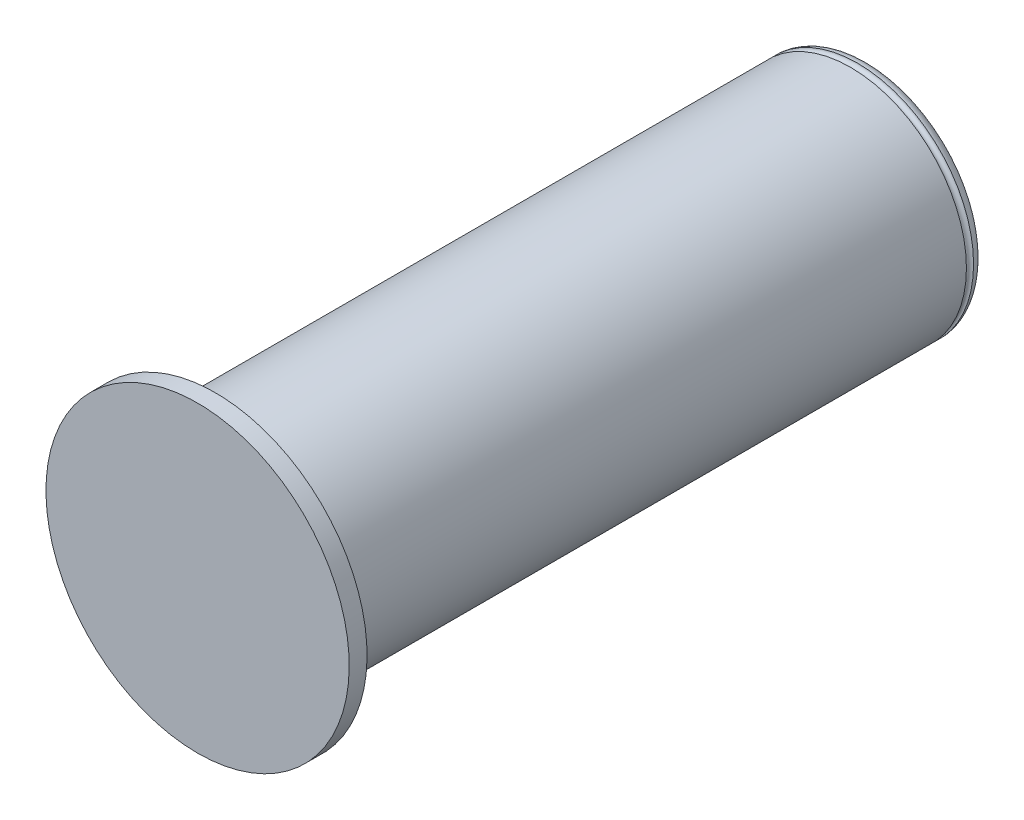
ISO-10303-21;
HEADER;
FILE_DESCRIPTION(('STEP AP214'),'2;1');
FILE_NAME('part.step','',(''),(''),'','','');
FILE_SCHEMA(('AUTOMOTIVE_DESIGN { 1 0 10303 214 1 1 1 1 }'));
ENDSEC;
DATA;
#1=APPLICATION_CONTEXT('core data for automotive mechanical design processes');
#2=APPLICATION_PROTOCOL_DEFINITION('international standard','automotive_design',2000,#1);
#3=PRODUCT_CONTEXT('',#1,'mechanical');
#4=PRODUCT('Part','Part','',(#3));
#5=PRODUCT_RELATED_PRODUCT_CATEGORY('part','',(#4));
#6=PRODUCT_DEFINITION_FORMATION('','',#4);
#7=PRODUCT_DEFINITION_CONTEXT('part definition',#1,'design');
#8=PRODUCT_DEFINITION('design','',#6,#7);
#9=PRODUCT_DEFINITION_SHAPE('','',#8);
#10=(LENGTH_UNIT() NAMED_UNIT(*) SI_UNIT(.MILLI.,.METRE.));
#11=(NAMED_UNIT(*) PLANE_ANGLE_UNIT() SI_UNIT($,.RADIAN.));
#12=(NAMED_UNIT(*) SI_UNIT($,.STERADIAN.) SOLID_ANGLE_UNIT());
#13=UNCERTAINTY_MEASURE_WITH_UNIT(LENGTH_MEASURE(1.E-05),#10,'distance_accuracy_value','');
#14=(GEOMETRIC_REPRESENTATION_CONTEXT(3) GLOBAL_UNCERTAINTY_ASSIGNED_CONTEXT((#13)) GLOBAL_UNIT_ASSIGNED_CONTEXT((#10,
#11,#12)) REPRESENTATION_CONTEXT('',''));
#15=CARTESIAN_POINT('',(0.,0.,0.));
#16=DIRECTION('',(0.,0.,1.));
#17=DIRECTION('',(1.,0.,0.));
#18=AXIS2_PLACEMENT_3D('',#15,#16,#17);
#19=CARTESIAN_POINT('',(0.,0.,-185.));
#20=DIRECTION('',(0.,0.,1.));
#21=DIRECTION('',(0.,-1.,0.));
#22=AXIS2_PLACEMENT_3D('',#19,#20,#21);
#23=TOROIDAL_SURFACE('',#22,29.5,3.);
#24=CARTESIAN_POINT('',(0.,0.,-184.999999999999));
#25=DIRECTION('',(0.,0.,1.));
#26=DIRECTION('',(1.,0.,0.));
#27=AXIS2_PLACEMENT_3D('',#24,#25,#26);
#28=CIRCLE('',#27,32.4999999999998);
#29=CARTESIAN_POINT('',(32.4999999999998,0.,-184.999999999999));
#30=VERTEX_POINT('',#29);
#31=EDGE_CURVE('E109',#30,#30,#28,.T.);
#32=ORIENTED_EDGE('',*,*,#31,.F.);
#33=EDGE_LOOP('',(#32));
#34=FACE_BOUND('',#33,.T.);
#35=CARTESIAN_POINT('',(0.,0.,-188.));
#36=DIRECTION('',(0.,0.,1.));
#37=DIRECTION('',(0.,-1.,0.));
#38=AXIS2_PLACEMENT_3D('',#35,#36,#37);
#39=CIRCLE('',#38,29.5);
#40=CARTESIAN_POINT('',(0.,-29.5,-188.));
#41=VERTEX_POINT('',#40);
#42=EDGE_CURVE('E92',#41,#41,#39,.T.);
#43=ORIENTED_EDGE('',*,*,#42,.T.);
#44=EDGE_LOOP('',(#43));
#45=FACE_BOUND('',#44,.T.);
#46=ADVANCED_FACE('F32',(#34,#45),#23,.T.);
#47=CARTESIAN_POINT('',(0.,29.5,-188.));
#48=DIRECTION('',(0.,0.,1.));
#49=DIRECTION('',(0.,-1.,0.));
#50=AXIS2_PLACEMENT_3D('',#47,#48,#49);
#51=PLANE('',#50);
#52=ORIENTED_EDGE('',*,*,#42,.F.);
#53=EDGE_LOOP('',(#52));
#54=FACE_BOUND('',#53,.T.);
#55=CARTESIAN_POINT('',(0.,0.,-188.));
#56=DIRECTION('',(0.,0.,1.));
#57=DIRECTION('',(0.,-1.,0.));
#58=AXIS2_PLACEMENT_3D('',#55,#56,#57);
#59=CIRCLE('',#58,4.49999999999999);
#60=CARTESIAN_POINT('',(0.,-4.49999999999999,-188.));
#61=VERTEX_POINT('',#60);
#62=EDGE_CURVE('E97',#61,#61,#59,.T.);
#63=ORIENTED_EDGE('',*,*,#62,.T.);
#64=EDGE_LOOP('',(#63));
#65=FACE_BOUND('',#64,.T.);
#66=ADVANCED_FACE('F60',(#54,#65),#51,.F.);
#67=CARTESIAN_POINT('',(0.,0.,-187.5));
#68=DIRECTION('',(0.,0.,-1.));
#69=DIRECTION('',(0.,1.,0.));
#70=AXIS2_PLACEMENT_3D('',#67,#68,#69);
#71=CONICAL_SURFACE('',#70,4.00000000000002,0.785398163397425);
#72=ORIENTED_EDGE('',*,*,#62,.F.);
#73=EDGE_LOOP('',(#72));
#74=FACE_BOUND('',#73,.T.);
#75=CARTESIAN_POINT('',(0.,0.,-187.5));
#76=DIRECTION('',(0.,0.,1.));
#77=DIRECTION('',(0.,-1.,0.));
#78=AXIS2_PLACEMENT_3D('',#75,#76,#77);
#79=CIRCLE('',#78,4.00000000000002);
#80=CARTESIAN_POINT('',(0.,-4.00000000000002,-187.5));
#81=VERTEX_POINT('',#80);
#82=EDGE_CURVE('E100',#81,#81,#79,.T.);
#83=ORIENTED_EDGE('',*,*,#82,.T.);
#84=EDGE_LOOP('',(#83));
#85=FACE_BOUND('',#84,.T.);
#86=ADVANCED_FACE('F55',(#74,#85),#71,.F.);
#87=CARTESIAN_POINT('',(0.,0.,0.));
#88=DIRECTION('',(0.,0.,1.));
#89=DIRECTION('',(0.,-1.,0.));
#90=AXIS2_PLACEMENT_3D('',#87,#88,#89);
#91=CYLINDRICAL_SURFACE('',#90,4.00000000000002);
#92=ORIENTED_EDGE('',*,*,#82,.F.);
#93=EDGE_LOOP('',(#92));
#94=FACE_BOUND('',#93,.T.);
#95=CARTESIAN_POINT('',(0.,0.,-179.));
#96=DIRECTION('',(0.,0.,1.));
#97=DIRECTION('',(0.,-1.,0.));
#98=AXIS2_PLACEMENT_3D('',#95,#96,#97);
#99=CIRCLE('',#98,4.00000000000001);
#100=CARTESIAN_POINT('',(0.,-4.00000000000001,-179.));
#101=VERTEX_POINT('',#100);
#102=EDGE_CURVE('E103',#101,#101,#99,.T.);
#103=ORIENTED_EDGE('',*,*,#102,.T.);
#104=EDGE_LOOP('',(#103));
#105=FACE_BOUND('',#104,.T.);
#106=ADVANCED_FACE('F45',(#94,#105),#91,.F.);
#107=CARTESIAN_POINT('',(0.,0.,-176.690598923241));
#108=DIRECTION('',(0.,0.,-1.));
#109=DIRECTION('',(0.,1.,0.));
#110=AXIS2_PLACEMENT_3D('',#107,#108,#109);
#111=CONICAL_SURFACE('',#110,0.,1.04719755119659);
#112=ORIENTED_EDGE('',*,*,#102,.F.);
#113=EDGE_LOOP('',(#112));
#114=FACE_BOUND('',#113,.T.);
#115=CARTESIAN_POINT('',(0.,0.,-176.690598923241));
#116=VERTEX_POINT('',#115);
#117=VERTEX_LOOP('',#116);
#118=FACE_BOUND('',#117,.T.);
#119=ADVANCED_FACE('F42',(#114,#118),#111,.F.);
#120=CARTESIAN_POINT('',(0.,0.,-184.));
#121=DIRECTION('',(0.,0.,-1.));
#122=DIRECTION('',(0.,1.,0.));
#123=AXIS2_PLACEMENT_3D('',#120,#121,#122);
#124=TOROIDAL_SURFACE('',#123,32.5,0.999999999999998);
#125=ORIENTED_EDGE('',*,*,#31,.T.);
#126=EDGE_LOOP('',(#125));
#127=FACE_BOUND('',#126,.T.);
#128=CARTESIAN_POINT('',(0.,0.,-183.));
#129=DIRECTION('',(0.,0.,-1.));
#130=DIRECTION('',(0.,1.,0.));
#131=AXIS2_PLACEMENT_3D('',#128,#129,#130);
#132=CIRCLE('',#131,32.5);
#133=CARTESIAN_POINT('',(0.,32.5,-183.));
#134=VERTEX_POINT('',#133);
#135=EDGE_CURVE('E106',#134,#134,#132,.T.);
#136=ORIENTED_EDGE('',*,*,#135,.T.);
#137=EDGE_LOOP('',(#136));
#138=FACE_BOUND('',#137,.T.);
#139=ADVANCED_FACE('F44',(#127,#138),#124,.F.);
#140=CARTESIAN_POINT('',(0.,0.,0.));
#141=DIRECTION('',(0.,0.,-1.));
#142=DIRECTION('',(0.,1.,0.));
#143=AXIS2_PLACEMENT_3D('',#140,#141,#142);
#144=PLANE('',#143);
#145=CARTESIAN_POINT('',(0.,0.,0.));
#146=DIRECTION('',(0.,0.,1.));
#147=DIRECTION('',(0.,-1.,0.));
#148=AXIS2_PLACEMENT_3D('',#145,#146,#147);
#149=CIRCLE('',#148,42.5);
#150=CARTESIAN_POINT('',(0.,-42.5,0.));
#151=VERTEX_POINT('',#150);
#152=EDGE_CURVE('E11',#151,#151,#149,.T.);
#153=ORIENTED_EDGE('',*,*,#152,.T.);
#154=EDGE_LOOP('',(#153));
#155=FACE_BOUND('',#154,.T.);
#156=ADVANCED_FACE('F34',(#155),#144,.F.);
#157=CARTESIAN_POINT('',(0.,0.,0.));
#158=DIRECTION('',(0.,0.,1.));
#159=DIRECTION('',(0.,-1.,0.));
#160=AXIS2_PLACEMENT_3D('',#157,#158,#159);
#161=CYLINDRICAL_SURFACE('',#160,42.5);
#162=ORIENTED_EDGE('',*,*,#152,.F.);
#163=EDGE_LOOP('',(#162));
#164=FACE_BOUND('',#163,.T.);
#165=CARTESIAN_POINT('',(0.,0.,-5.));
#166=DIRECTION('',(0.,0.,1.));
#167=DIRECTION('',(0.,-1.,0.));
#168=AXIS2_PLACEMENT_3D('',#165,#166,#167);
#169=CIRCLE('',#168,42.5);
#170=CARTESIAN_POINT('',(0.,-42.5,-5.));
#171=VERTEX_POINT('',#170);
#172=EDGE_CURVE('E39',#171,#171,#169,.T.);
#173=ORIENTED_EDGE('',*,*,#172,.T.);
#174=EDGE_LOOP('',(#173));
#175=FACE_BOUND('',#174,.T.);
#176=ADVANCED_FACE('F78',(#164,#175),#161,.T.);
#177=CARTESIAN_POINT('',(0.,42.5,-5.));
#178=DIRECTION('',(0.,0.,1.));
#179=DIRECTION('',(0.,-1.,0.));
#180=AXIS2_PLACEMENT_3D('',#177,#178,#179);
#181=PLANE('',#180);
#182=ORIENTED_EDGE('',*,*,#172,.F.);
#183=EDGE_LOOP('',(#182));
#184=FACE_BOUND('',#183,.T.);
#185=CARTESIAN_POINT('',(0.,0.,-5.));
#186=DIRECTION('',(0.,0.,1.));
#187=DIRECTION('',(0.,-1.,0.));
#188=AXIS2_PLACEMENT_3D('',#185,#186,#187);
#189=CIRCLE('',#188,32.5);
#190=CARTESIAN_POINT('',(0.,-32.5,-5.));
#191=VERTEX_POINT('',#190);
#192=EDGE_CURVE('E90',#191,#191,#189,.T.);
#193=ORIENTED_EDGE('',*,*,#192,.T.);
#194=EDGE_LOOP('',(#193));
#195=FACE_BOUND('',#194,.T.);
#196=ADVANCED_FACE('F76',(#184,#195),#181,.F.);
#197=CARTESIAN_POINT('',(0.,0.,0.));
#198=DIRECTION('',(0.,0.,1.));
#199=DIRECTION('',(0.,-1.,0.));
#200=AXIS2_PLACEMENT_3D('',#197,#198,#199);
#201=CYLINDRICAL_SURFACE('',#200,32.5);
#202=ORIENTED_EDGE('',*,*,#192,.F.);
#203=EDGE_LOOP('',(#202));
#204=FACE_BOUND('',#203,.T.);
#205=ORIENTED_EDGE('',*,*,#135,.F.);
#206=EDGE_LOOP('',(#205));
#207=FACE_BOUND('',#206,.T.);
#208=ADVANCED_FACE('F73',(#204,#207),#201,.T.);
#209=CLOSED_SHELL('',(#46,#66,#86,#106,#119,#139,#156,#176,#196,#208));
#210=MANIFOLD_SOLID_BREP('B2',#209);
#211=ADVANCED_BREP_SHAPE_REPRESENTATION('',(#18,#210),#14);
#212=SHAPE_DEFINITION_REPRESENTATION(#9,#211);
ENDSEC;
END-ISO-10303-21;
